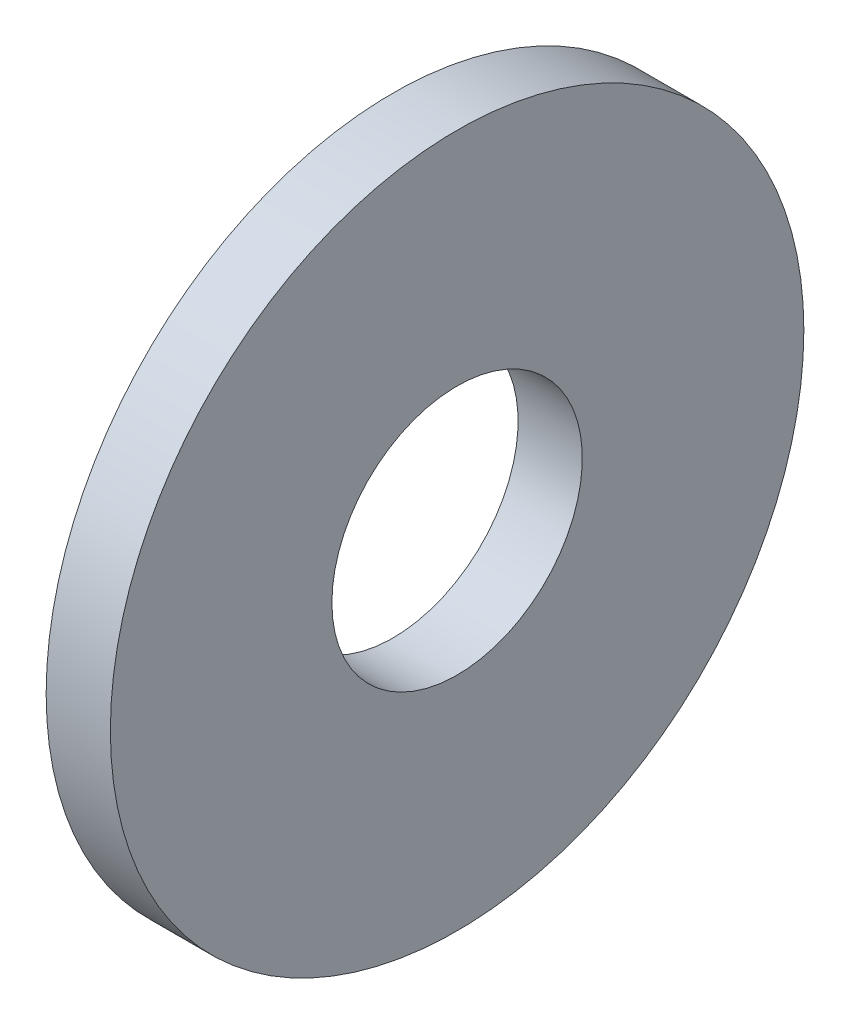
from build123d import *

# Parameters (mm, degrees)
SKETCH1_W = 10
SKETCH1_H = 34.5


with BuildPart() as part:
    # Sketch1 → Base-Revolve (revolve)
    with BuildSketch(Plane.XY, mode=Mode.PRIVATE) as base_revolve_sk:
        with Locations((-5, 36.75)):
            Rectangle(SKETCH1_W, SKETCH1_H)
    revolve(base_revolve_sk.sketch.rotate(Axis((-34.925, 0, 0), (1, 0, 0)), 90), axis=Axis((-34.925, 0, 0), (1, 0, 0)))


solid = part.part
